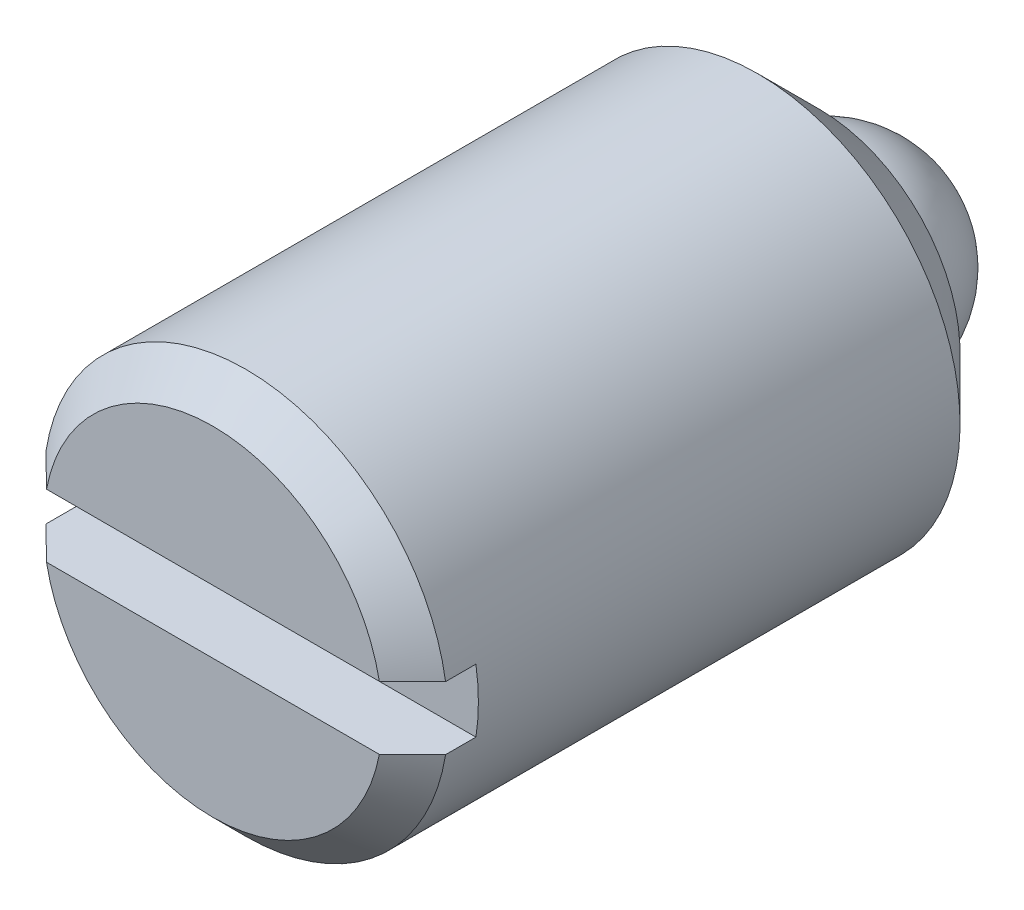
ISO-10303-21;
HEADER;
FILE_DESCRIPTION(('STEP AP214'),'2;1');
FILE_NAME('part.step','',(''),(''),'','','');
FILE_SCHEMA(('AUTOMOTIVE_DESIGN { 1 0 10303 214 1 1 1 1 }'));
ENDSEC;
DATA;
#1=APPLICATION_CONTEXT('core data for automotive mechanical design processes');
#2=APPLICATION_PROTOCOL_DEFINITION('international standard','automotive_design',2000,#1);
#3=PRODUCT_CONTEXT('',#1,'mechanical');
#4=PRODUCT('Part','Part','',(#3));
#5=PRODUCT_RELATED_PRODUCT_CATEGORY('part','',(#4));
#6=PRODUCT_DEFINITION_FORMATION('','',#4);
#7=PRODUCT_DEFINITION_CONTEXT('part definition',#1,'design');
#8=PRODUCT_DEFINITION('design','',#6,#7);
#9=PRODUCT_DEFINITION_SHAPE('','',#8);
#10=(LENGTH_UNIT() NAMED_UNIT(*) SI_UNIT(.MILLI.,.METRE.));
#11=(NAMED_UNIT(*) PLANE_ANGLE_UNIT() SI_UNIT($,.RADIAN.));
#12=(NAMED_UNIT(*) SI_UNIT($,.STERADIAN.) SOLID_ANGLE_UNIT());
#13=UNCERTAINTY_MEASURE_WITH_UNIT(LENGTH_MEASURE(1.E-05),#10,'distance_accuracy_value','');
#14=(GEOMETRIC_REPRESENTATION_CONTEXT(3) GLOBAL_UNCERTAINTY_ASSIGNED_CONTEXT((#13)) GLOBAL_UNIT_ASSIGNED_CONTEXT((#10,
#11,#12)) REPRESENTATION_CONTEXT('',''));
#15=CARTESIAN_POINT('',(0.,0.,0.));
#16=DIRECTION('',(0.,0.,1.));
#17=DIRECTION('',(1.,0.,0.));
#18=AXIS2_PLACEMENT_3D('',#15,#16,#17);
#19=CARTESIAN_POINT('',(0.,8.,28.5));
#20=DIRECTION('',(0.,0.,1.));
#21=DIRECTION('',(1.,0.,0.));
#22=AXIS2_PLACEMENT_3D('',#19,#20,#21);
#23=PLANE('',#22);
#24=DIRECTION('',(1.,0.,0.));
#25=VECTOR('',#24,1.);
#26=CARTESIAN_POINT('',(-7.90174031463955,1.25,28.5));
#27=LINE('',#26,#25);
#28=CARTESIAN_POINT('',(-6.58236279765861,1.25,28.5));
#29=VERTEX_POINT('',#28);
#30=CARTESIAN_POINT('',(6.58236279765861,1.25,28.5));
#31=VERTEX_POINT('',#30);
#32=EDGE_CURVE('E77',#29,#31,#27,.T.);
#33=ORIENTED_EDGE('',*,*,#32,.T.);
#34=CARTESIAN_POINT('',(0.,0.,28.5));
#35=DIRECTION('',(0.,0.,1.));
#36=DIRECTION('',(0.,-1.,0.));
#37=AXIS2_PLACEMENT_3D('',#34,#35,#36);
#38=CIRCLE('',#37,6.7);
#39=EDGE_CURVE('E9',#31,#29,#38,.T.);
#40=ORIENTED_EDGE('',*,*,#39,.T.);
#41=EDGE_LOOP('',(#33,#40));
#42=FACE_BOUND('',#41,.T.);
#43=ADVANCED_FACE('F14',(#42),#23,.T.);
#44=CARTESIAN_POINT('',(0.,0.,-3.5));
#45=DIRECTION('',(0.,0.,-1.));
#46=DIRECTION('',(-1.,0.,0.));
#47=AXIS2_PLACEMENT_3D('',#44,#45,#46);
#48=CYLINDRICAL_SURFACE('',#47,8.);
#49=CARTESIAN_POINT('',(0.,0.,6.95));
#50=DIRECTION('',(0.,0.,-1.));
#51=DIRECTION('',(0.,1.,0.));
#52=AXIS2_PLACEMENT_3D('',#49,#50,#51);
#53=CIRCLE('',#52,8.);
#54=CARTESIAN_POINT('',(0.,8.,6.95));
#55=VERTEX_POINT('',#54);
#56=EDGE_CURVE('E113',#55,#55,#53,.F.);
#57=ORIENTED_EDGE('',*,*,#56,.T.);
#58=EDGE_LOOP('',(#57));
#59=FACE_BOUND('',#58,.T.);
#60=DIRECTION('',(0.,0.,1.));
#61=VECTOR('',#60,1.);
#62=CARTESIAN_POINT('',(7.90174031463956,-1.25,26.5));
#63=LINE('',#62,#61);
#64=CARTESIAN_POINT('',(7.90174031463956,-1.25,26.));
#65=VERTEX_POINT('',#64);
#66=CARTESIAN_POINT('',(7.90174031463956,-1.25,27.2));
#67=VERTEX_POINT('',#66);
#68=EDGE_CURVE('E76',#65,#67,#63,.T.);
#69=ORIENTED_EDGE('',*,*,#68,.T.);
#70=CARTESIAN_POINT('',(0.,0.,27.2));
#71=DIRECTION('',(0.,0.,1.));
#72=DIRECTION('',(0.,-1.,0.));
#73=AXIS2_PLACEMENT_3D('',#70,#71,#72);
#74=CIRCLE('',#73,8.);
#75=CARTESIAN_POINT('',(-7.90174031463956,-1.25,27.2));
#76=VERTEX_POINT('',#75);
#77=EDGE_CURVE('E74',#67,#76,#74,.F.);
#78=ORIENTED_EDGE('',*,*,#77,.T.);
#79=DIRECTION('',(0.,0.,1.));
#80=VECTOR('',#79,1.);
#81=CARTESIAN_POINT('',(-7.90174031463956,-1.25,26.5));
#82=LINE('',#81,#80);
#83=CARTESIAN_POINT('',(-7.90174031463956,-1.25,26.));
#84=VERTEX_POINT('',#83);
#85=EDGE_CURVE('E66',#84,#76,#82,.T.);
#86=ORIENTED_EDGE('',*,*,#85,.F.);
#87=CARTESIAN_POINT('',(0.,0.,26.));
#88=DIRECTION('',(0.,0.,1.));
#89=DIRECTION('',(0.,-1.,0.));
#90=AXIS2_PLACEMENT_3D('',#87,#88,#89);
#91=CIRCLE('',#90,8.);
#92=CARTESIAN_POINT('',(-7.90174031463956,1.25,26.));
#93=VERTEX_POINT('',#92);
#94=EDGE_CURVE('E72',#93,#84,#91,.T.);
#95=ORIENTED_EDGE('',*,*,#94,.F.);
#96=DIRECTION('',(0.,0.,1.));
#97=VECTOR('',#96,1.);
#98=CARTESIAN_POINT('',(-7.90174031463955,1.25,26.5));
#99=LINE('',#98,#97);
#100=CARTESIAN_POINT('',(-7.90174031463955,1.25,27.2));
#101=VERTEX_POINT('',#100);
#102=EDGE_CURVE('E102',#93,#101,#99,.T.);
#103=ORIENTED_EDGE('',*,*,#102,.T.);
#104=CARTESIAN_POINT('',(0.,0.,27.2));
#105=DIRECTION('',(0.,0.,1.));
#106=DIRECTION('',(0.,-1.,0.));
#107=AXIS2_PLACEMENT_3D('',#104,#105,#106);
#108=CIRCLE('',#107,8.);
#109=CARTESIAN_POINT('',(7.90174031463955,1.25,27.2));
#110=VERTEX_POINT('',#109);
#111=EDGE_CURVE('E116',#101,#110,#108,.F.);
#112=ORIENTED_EDGE('',*,*,#111,.T.);
#113=DIRECTION('',(0.,0.,1.));
#114=VECTOR('',#113,1.);
#115=CARTESIAN_POINT('',(7.90174031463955,1.25,26.5));
#116=LINE('',#115,#114);
#117=CARTESIAN_POINT('',(7.90174031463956,1.25,26.));
#118=VERTEX_POINT('',#117);
#119=EDGE_CURVE('E100',#118,#110,#116,.T.);
#120=ORIENTED_EDGE('',*,*,#119,.F.);
#121=CARTESIAN_POINT('',(0.,0.,26.));
#122=DIRECTION('',(0.,0.,1.));
#123=DIRECTION('',(0.,-1.,0.));
#124=AXIS2_PLACEMENT_3D('',#121,#122,#123);
#125=CIRCLE('',#124,8.);
#126=EDGE_CURVE('E85',#65,#118,#125,.T.);
#127=ORIENTED_EDGE('',*,*,#126,.F.);
#128=EDGE_LOOP('',(#69,#78,#86,#95,#103,#112,#120,#127));
#129=FACE_BOUND('',#128,.T.);
#130=ADVANCED_FACE('F69',(#59,#129),#48,.T.);
#131=CARTESIAN_POINT('',(0.,4.25,4.5));
#132=DIRECTION('',(0.,0.,-1.));
#133=DIRECTION('',(-1.,0.,0.));
#134=AXIS2_PLACEMENT_3D('',#131,#132,#133);
#135=PLANE('',#134);
#136=CARTESIAN_POINT('',(0.,0.,4.5));
#137=DIRECTION('',(0.,0.,-1.));
#138=DIRECTION('',(0.,1.,0.));
#139=AXIS2_PLACEMENT_3D('',#136,#137,#138);
#140=CIRCLE('',#139,5.55);
#141=CARTESIAN_POINT('',(0.,5.55,4.5));
#142=VERTEX_POINT('',#141);
#143=EDGE_CURVE('E110',#142,#142,#140,.T.);
#144=ORIENTED_EDGE('',*,*,#143,.T.);
#145=EDGE_LOOP('',(#144));
#146=FACE_BOUND('',#145,.T.);
#147=CARTESIAN_POINT('',(0.,0.,4.5));
#148=DIRECTION('',(0.,0.,-1.));
#149=DIRECTION('',(-1.,0.,0.));
#150=AXIS2_PLACEMENT_3D('',#147,#148,#149);
#151=CIRCLE('',#150,4.25);
#152=CARTESIAN_POINT('',(-4.25,0.,4.5));
#153=VERTEX_POINT('',#152);
#154=EDGE_CURVE('E107',#153,#153,#151,.T.);
#155=ORIENTED_EDGE('',*,*,#154,.F.);
#156=EDGE_LOOP('',(#155));
#157=FACE_BOUND('',#156,.T.);
#158=ADVANCED_FACE('F179',(#146,#157),#135,.T.);
#159=CARTESIAN_POINT('',(0.,0.,-3.5));
#160=DIRECTION('',(0.,0.,-1.));
#161=DIRECTION('',(-1.,0.,0.));
#162=AXIS2_PLACEMENT_3D('',#159,#160,#161);
#163=CYLINDRICAL_SURFACE('',#162,4.25);
#164=CARTESIAN_POINT('',(0.,0.,4.25));
#165=DIRECTION('',(0.,0.,-1.));
#166=DIRECTION('',(-1.,0.,0.));
#167=AXIS2_PLACEMENT_3D('',#164,#165,#166);
#168=CIRCLE('',#167,4.25);
#169=CARTESIAN_POINT('',(-4.25,0.,4.25));
#170=VERTEX_POINT('',#169);
#171=EDGE_CURVE('E104',#170,#170,#168,.T.);
#172=ORIENTED_EDGE('',*,*,#171,.F.);
#173=EDGE_LOOP('',(#172));
#174=FACE_BOUND('',#173,.T.);
#175=ORIENTED_EDGE('',*,*,#154,.T.);
#176=EDGE_LOOP('',(#175));
#177=FACE_BOUND('',#176,.T.);
#178=ADVANCED_FACE('F188',(#174,#177),#163,.T.);
#179=CARTESIAN_POINT('',(0.,0.,4.25));
#180=DIRECTION('',(-1.,0.,0.));
#181=DIRECTION('',(0.,0.,1.));
#182=AXIS2_PLACEMENT_3D('',#179,#180,#181);
#183=SPHERICAL_SURFACE('',#182,4.25);
#184=CARTESIAN_POINT('',(0.,0.,4.25));
#185=DIRECTION('',(0.,0.,-1.));
#186=DIRECTION('',(-1.,0.,0.));
#187=AXIS2_PLACEMENT_3D('',#184,#185,#186);
#188=SPHERICAL_SURFACE('',#187,4.25);
#189=ORIENTED_EDGE('',*,*,#171,.T.);
#190=EDGE_LOOP('',(#189));
#191=FACE_BOUND('',#190,.T.);
#192=ADVANCED_FACE('F183',(#191),#188,.T.);
#193=DIRECTION('',(1.,0.,0.));
#194=VECTOR('',#193,1.);
#195=CARTESIAN_POINT('',(-7.90174031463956,-1.25,28.5));
#196=LINE('',#195,#194);
#197=CARTESIAN_POINT('',(-6.58236279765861,-1.25,28.5));
#198=VERTEX_POINT('',#197);
#199=CARTESIAN_POINT('',(6.58236279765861,-1.25,28.5));
#200=VERTEX_POINT('',#199);
#201=EDGE_CURVE('E95',#198,#200,#196,.T.);
#202=ORIENTED_EDGE('',*,*,#201,.F.);
#203=CARTESIAN_POINT('',(0.,0.,28.5));
#204=DIRECTION('',(0.,0.,1.));
#205=DIRECTION('',(0.,-1.,0.));
#206=AXIS2_PLACEMENT_3D('',#203,#204,#205);
#207=CIRCLE('',#206,6.7);
#208=EDGE_CURVE('E158',#198,#200,#207,.T.);
#209=ORIENTED_EDGE('',*,*,#208,.T.);
#210=EDGE_LOOP('',(#202,#209));
#211=FACE_BOUND('',#210,.T.);
#212=ADVANCED_FACE('F145',(#211),#23,.T.);
#213=CARTESIAN_POINT('',(-7.90174031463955,1.25,26.5));
#214=DIRECTION('',(0.,-1.,0.));
#215=DIRECTION('',(1.,0.,0.));
#216=AXIS2_PLACEMENT_3D('',#213,#214,#215);
#217=PLANE('',#216);
#218=ORIENTED_EDGE('',*,*,#119,.T.);
#219=CARTESIAN_POINT('',(7.90174031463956,1.25,27.2));
#220=CARTESIAN_POINT('',(7.68210487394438,1.25,27.4169310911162));
#221=CARTESIAN_POINT('',(7.46236593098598,1.25,27.6337575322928));
#222=CARTESIAN_POINT('',(7.13254175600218,1.25,27.9587781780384));
#223=CARTESIAN_POINT('',(7.02256440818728,1.25,28.0670818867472));
#224=CARTESIAN_POINT('',(6.8025276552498,1.25,28.2836060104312));
#225=CARTESIAN_POINT('',(6.69246825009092,1.25,28.3918264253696));
#226=CARTESIAN_POINT('',(6.58236279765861,1.25,28.5));
#227=B_SPLINE_CURVE_WITH_KNOTS('',3,(#219,#220,#221,#222,#223,#224,#225,#226),.UNSPECIFIED.,.F.,
.F.,(4,2,2,4),(0.,0.926115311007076,1.38917293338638,1.85223076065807),.UNSPECIFIED.);
#228=EDGE_CURVE('E23',#110,#31,#227,.T.);
#229=ORIENTED_EDGE('',*,*,#228,.T.);
#230=ORIENTED_EDGE('',*,*,#32,.F.);
#231=CARTESIAN_POINT('',(-6.58236279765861,1.25,28.5));
#232=CARTESIAN_POINT('',(-6.69246825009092,1.25,28.3918264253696));
#233=CARTESIAN_POINT('',(-6.8025276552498,1.25,28.2836060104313));
#234=CARTESIAN_POINT('',(-7.02256440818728,1.25,28.0670818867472));
#235=CARTESIAN_POINT('',(-7.13254175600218,1.25,27.9587781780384));
#236=CARTESIAN_POINT('',(-7.46236593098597,1.25,27.6337575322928));
#237=CARTESIAN_POINT('',(-7.68210487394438,1.25,27.4169310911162));
#238=CARTESIAN_POINT('',(-7.90174031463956,1.25,27.2));
#239=B_SPLINE_CURVE_WITH_KNOTS('',3,(#231,#232,#233,#234,#235,#236,#237,#238),.UNSPECIFIED.,.F.,
.F.,(4,2,2,4),(0.,0.463057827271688,0.926115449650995,1.85223076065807),.UNSPECIFIED.);
#240=EDGE_CURVE('E149',#29,#101,#239,.T.);
#241=ORIENTED_EDGE('',*,*,#240,.T.);
#242=ORIENTED_EDGE('',*,*,#102,.F.);
#243=DIRECTION('',(-1.,0.,0.));
#244=VECTOR('',#243,1.);
#245=CARTESIAN_POINT('',(7.90174031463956,1.25,26.));
#246=LINE('',#245,#244);
#247=EDGE_CURVE('E90',#118,#93,#246,.T.);
#248=ORIENTED_EDGE('',*,*,#247,.F.);
#249=EDGE_LOOP('',(#218,#229,#230,#241,#242,#248));
#250=FACE_BOUND('',#249,.T.);
#251=ADVANCED_FACE('F140',(#250),#217,.T.);
#252=CARTESIAN_POINT('',(-7.90174031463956,-1.25,26.5));
#253=DIRECTION('',(0.,-1.,0.));
#254=DIRECTION('',(1.,0.,0.));
#255=AXIS2_PLACEMENT_3D('',#252,#253,#254);
#256=PLANE('',#255);
#257=ORIENTED_EDGE('',*,*,#85,.T.);
#258=CARTESIAN_POINT('',(-7.90174031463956,-1.25,27.2));
#259=CARTESIAN_POINT('',(-7.68210487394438,-1.25,27.4169310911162));
#260=CARTESIAN_POINT('',(-7.46236593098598,-1.25,27.6337575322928));
#261=CARTESIAN_POINT('',(-7.13254175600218,-1.25,27.9587781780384));
#262=CARTESIAN_POINT('',(-7.02256440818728,-1.25,28.0670818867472));
#263=CARTESIAN_POINT('',(-6.8025276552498,-1.25,28.2836060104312));
#264=CARTESIAN_POINT('',(-6.69246825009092,-1.25,28.3918264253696));
#265=CARTESIAN_POINT('',(-6.58236279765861,-1.25,28.5));
#266=B_SPLINE_CURVE_WITH_KNOTS('',3,(#258,#259,#260,#261,#262,#263,#264,#265),.UNSPECIFIED.,.F.,
.F.,(4,2,2,4),(0.,0.926115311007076,1.38917293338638,1.85223076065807),.UNSPECIFIED.);
#267=EDGE_CURVE('E127',#76,#198,#266,.T.);
#268=ORIENTED_EDGE('',*,*,#267,.T.);
#269=ORIENTED_EDGE('',*,*,#201,.T.);
#270=CARTESIAN_POINT('',(6.58236279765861,-1.25,28.5));
#271=CARTESIAN_POINT('',(6.69246825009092,-1.25,28.3918264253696));
#272=CARTESIAN_POINT('',(6.8025276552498,-1.25,28.2836060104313));
#273=CARTESIAN_POINT('',(7.02256440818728,-1.25,28.0670818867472));
#274=CARTESIAN_POINT('',(7.13254175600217,-1.25,27.9587781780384));
#275=CARTESIAN_POINT('',(7.46236593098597,-1.25,27.6337575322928));
#276=CARTESIAN_POINT('',(7.68210487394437,-1.25,27.4169310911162));
#277=CARTESIAN_POINT('',(7.90174031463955,-1.25,27.2));
#278=B_SPLINE_CURVE_WITH_KNOTS('',3,(#270,#271,#272,#273,#274,#275,#276,#277),.UNSPECIFIED.,.F.,
.F.,(4,2,2,4),(0.,0.463057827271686,0.92611544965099,1.85223076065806),.UNSPECIFIED.);
#279=EDGE_CURVE('E120',#200,#67,#278,.T.);
#280=ORIENTED_EDGE('',*,*,#279,.T.);
#281=ORIENTED_EDGE('',*,*,#68,.F.);
#282=DIRECTION('',(1.,0.,0.));
#283=VECTOR('',#282,1.);
#284=CARTESIAN_POINT('',(-7.90174031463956,-1.25,26.));
#285=LINE('',#284,#283);
#286=EDGE_CURVE('E80',#84,#65,#285,.T.);
#287=ORIENTED_EDGE('',*,*,#286,.F.);
#288=EDGE_LOOP('',(#257,#268,#269,#280,#281,#287));
#289=FACE_BOUND('',#288,.T.);
#290=ADVANCED_FACE('F81',(#289),#256,.F.);
#291=CARTESIAN_POINT('',(0.,0.,26.));
#292=DIRECTION('',(0.,0.,1.));
#293=DIRECTION('',(0.,-1.,0.));
#294=AXIS2_PLACEMENT_3D('',#291,#292,#293);
#295=PLANE('',#294);
#296=ORIENTED_EDGE('',*,*,#94,.T.);
#297=ORIENTED_EDGE('',*,*,#286,.T.);
#298=ORIENTED_EDGE('',*,*,#126,.T.);
#299=ORIENTED_EDGE('',*,*,#247,.T.);
#300=EDGE_LOOP('',(#296,#297,#298,#299));
#301=FACE_BOUND('',#300,.T.);
#302=ADVANCED_FACE('F88',(#301),#295,.T.);
#303=CARTESIAN_POINT('',(0.,0.,4.5));
#304=DIRECTION('',(0.,0.,1.));
#305=DIRECTION('',(0.,-1.,0.));
#306=AXIS2_PLACEMENT_3D('',#303,#304,#305);
#307=CONICAL_SURFACE('',#306,5.55,0.785398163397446);
#308=ORIENTED_EDGE('',*,*,#56,.F.);
#309=EDGE_LOOP('',(#308));
#310=FACE_BOUND('',#309,.T.);
#311=ORIENTED_EDGE('',*,*,#143,.F.);
#312=EDGE_LOOP('',(#311));
#313=FACE_BOUND('',#312,.T.);
#314=ADVANCED_FACE('F173',(#310,#313),#307,.T.);
#315=CARTESIAN_POINT('',(0.,0.,27.2));
#316=DIRECTION('',(0.,0.,-1.));
#317=DIRECTION('',(0.,1.,0.));
#318=AXIS2_PLACEMENT_3D('',#315,#316,#317);
#319=CONICAL_SURFACE('',#318,8.,0.78539816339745);
#320=ORIENTED_EDGE('',*,*,#279,.F.);
#321=ORIENTED_EDGE('',*,*,#208,.F.);
#322=ORIENTED_EDGE('',*,*,#267,.F.);
#323=ORIENTED_EDGE('',*,*,#77,.F.);
#324=EDGE_LOOP('',(#320,#321,#322,#323));
#325=FACE_BOUND('',#324,.T.);
#326=ADVANCED_FACE('F133',(#325),#319,.T.);
#327=CARTESIAN_POINT('',(0.,0.,27.2));
#328=DIRECTION('',(0.,0.,-1.));
#329=DIRECTION('',(0.,1.,0.));
#330=AXIS2_PLACEMENT_3D('',#327,#328,#329);
#331=CONICAL_SURFACE('',#330,8.,0.78539816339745);
#332=ORIENTED_EDGE('',*,*,#240,.F.);
#333=ORIENTED_EDGE('',*,*,#39,.F.);
#334=ORIENTED_EDGE('',*,*,#228,.F.);
#335=ORIENTED_EDGE('',*,*,#111,.F.);
#336=EDGE_LOOP('',(#332,#333,#334,#335));
#337=FACE_BOUND('',#336,.T.);
#338=ADVANCED_FACE('F16',(#337),#331,.T.);
#339=CLOSED_SHELL('',(#43,#130,#158,#178,#192,#212,#251,#290,#302,#314,#326,#338));
#340=MANIFOLD_SOLID_BREP('B1',#339);
#341=ADVANCED_BREP_SHAPE_REPRESENTATION('',(#18,#340),#14);
#342=SHAPE_DEFINITION_REPRESENTATION(#9,#341);
ENDSEC;
END-ISO-10303-21;
